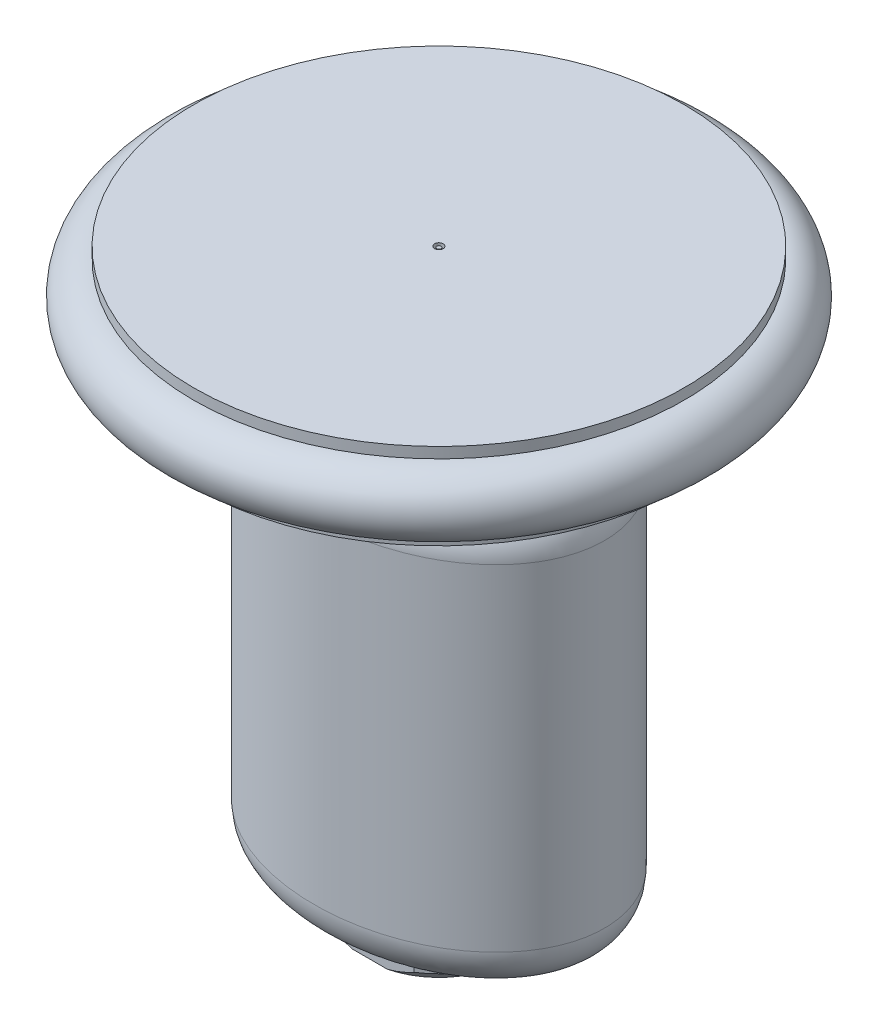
from build123d import *

# Parameters (mm, degrees)
SKETCH1_RX          = 9.779
SKETCH1_RY          = 7.366
BOSS_EXTRUDE1_DEPTH = 24.892
FILLET1_R           = 2.54
SKETCH2_R           = 2.921
BOSS_EXTRUDE2_DEPTH = 1.27
SKETCH3_R           = 2.794
CUT_EXTRUDE1_DEPTH  = 0.0635
SKETCH4_R           = 0.127
BOSS_EXTRUDE3_DEPTH = 6.35
BOSS_EXTRUDE4_DEPTH = 1.905
CHAMFER1_SIZE       = 0.635
SKETCH6_R           = 14.478
SKETCH6_R_2         = 0.254
BOSS_EXTRUDE5_DEPTH = 5.08
SKETCH7_R           = 1.778
SKETCH8_R           = 1.905


with BuildPart() as part:
    # Sketch1 → Boss-Extrude1 (new body)
    with BuildSketch(Plane(origin=(0, 0, 0), x_dir=(1, 0, 0), z_dir=(0, 1, 0))):
        with Locations(Location((0, 0), (0, 0, 180))):
            Ellipse(SKETCH1_RX, SKETCH1_RY)
    extrude(amount=BOSS_EXTRUDE1_DEPTH)

    # Fillet1
    fillet1_edges = [part.edges().sort_by_distance(p)[0] for p in [
        (9.778999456, 0, -0.002456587),
        (9.778999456, 24.892, -0.002456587),
    ]]
    fillet(fillet1_edges, radius=FILLET1_R)

    # Sketch2 → Boss-Extrude2 (add)
    with BuildSketch(Plane(origin=(0, 24.892, 0), x_dir=(1, 0, 0), z_dir=(0, 1, 0))):
        with Locations(Location((0, 0, 0), (0, 0, 270))):
            Circle(SKETCH2_R)
    extrude(amount=BOSS_EXTRUDE2_DEPTH)

    # Sketch3 → Cut-Extrude1 (cut)
    with BuildSketch(Plane(origin=(0, 26.162, 0), x_dir=(1, 0, 0), z_dir=(0, 1, 0))):
        with Locations(Location((0, 0, 0), (0, 0, 270))):
            Circle(SKETCH3_R)
    extrude(amount=-CUT_EXTRUDE1_DEPTH, mode=Mode.SUBTRACT)

    # Sketch4 → Boss-Extrude3 (add)
    with BuildSketch(Plane(origin=(0, 26.0985, 0), x_dir=(1, 0, 0), z_dir=(0, 1, 0))):
        with Locations(Location((0, 0, 0), (0, 0, 270))):
            Circle(SKETCH4_R)
    extrude(amount=BOSS_EXTRUDE3_DEPTH)

    # Sketch5 → Boss-Extrude4 (add)
    with BuildSketch(Plane.XZ):
        with BuildLine():
            Line((2.602725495, 4.064), (-2.602725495, 4.064))
            ThreePointArc((-2.602725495, 4.064), (-2.316195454, -4.233853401), (4.826, 0))
            ThreePointArc((4.826, 0), (4.233853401, 2.316195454), (2.602725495, 4.064))
        make_face()
    extrude(amount=BOSS_EXTRUDE4_DEPTH)

    # Chamfer1
    chamfer1_edges = [part.edges().sort_by_distance(p)[0] for p in [
        (0, -1.905, -4.826),
    ]]
    chamfer(chamfer1_edges, length=CHAMFER1_SIZE)


with BuildPart() as body_2:
    # Sketch6 → Boss-Extrude5 (new body)
    with BuildSketch(Plane(origin=(0, 27.432, 0), x_dir=(1, 0, 0), z_dir=(0, 1, 0))):
        with Locations(Location((0, 0, 0), (0, 0, 270))):
            Circle(SKETCH6_R)
        with Locations(Location((0, 0, 0), (0, 0, 270))):
            Circle(SKETCH6_R_2, mode=Mode.SUBTRACT)
    extrude(amount=BOSS_EXTRUDE5_DEPTH)

    # Sketch7 → Cut-Revolve1 (revolve, cut)
    with BuildSketch(Plane.XY, mode=Mode.PRIVATE) as cut_revolve1_sk:
        with Locations((14.478, 29.972)):
            Circle(SKETCH7_R)
    revolve(cut_revolve1_sk.sketch.rotate(Axis((0, 32.4485, 0), (0, -1, 0)), 90), axis=Axis((0, 32.4485, 0), (0, -1, 0)), mode=Mode.SUBTRACT)

    # Sketch8 → Revolve1 (revolve)
    with BuildSketch(Plane.XY, mode=Mode.PRIVATE) as revolve1_sk:
        with Locations((14.478, 29.972)):
            Circle(SKETCH8_R)
    revolve(revolve1_sk.sketch.rotate(Axis((0, 32.4485, 0), (0, -1, 0)), 90), axis=Axis((0, 32.4485, 0), (0, -1, 0)))


solid = Compound([part.part, body_2.part])
